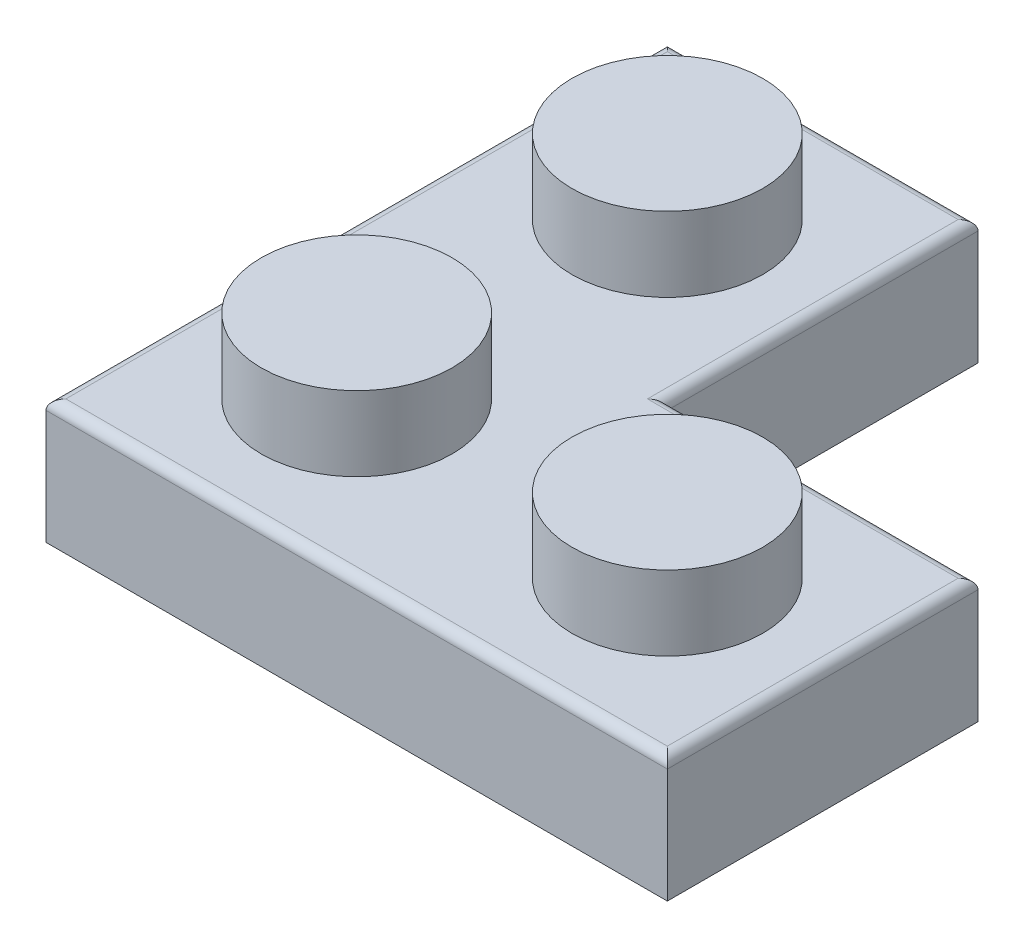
from build123d import *

# Parameters (mm, degrees)
SKETCH1_W               = 15.875
SKETCH1_H               = 15.875
BASE_EXTRUDE_DEPTH      = 3.175
SKETCH2_R               = 2.4384
BOSS_EXTRUDE1_DEPTH     = 1.905
LPATTERN4_COUNT         = 2
LPATTERN4_PITCH         = 7.9375
LPATTERN4_COUNT_DIR2    = 2
LPATTERN4_PITCH_DIR2    = 7.9375
CUT_EXTRUDE1_DEPTH      = 7.9375
CUT_EXTRUDE1_DEPTH_BACK = 12.6656949
SHELL1_T                = -1.5875
SKETCH4_R               = 1.27
BOSS_EXTRUDE2_DEPTH     = 1.5875
CUT_EXTRUDE2_START      = -1.5875
SKETCH5_R               = 0.635
CUT_EXTRUDE2_DEPTH      = 1.5875
FILLET1_R               = 0.254


with BuildPart() as part:
    # Sketch1 → Base-Extrude (new body)
    with BuildSketch(Plane(origin=(0, 0, 0), x_dir=(1, 0, 0), z_dir=(0, 1, 0))):
        Rectangle(SKETCH1_W, SKETCH1_H)
    extrude(amount=BASE_EXTRUDE_DEPTH)

    # Sketch2 → Boss-Extrude1 (add)
    with BuildSketch(Plane(origin=(0, 3.175, 0), x_dir=(-1, 0, 0), z_dir=(0, 1, 0))):
        with Locations(Location((3.96875, 3.96875, 0), (0, 0, 270))):
            Circle(SKETCH2_R)
    boss_extrude1 = extrude(amount=BOSS_EXTRUDE1_DEPTH)

    # LPattern4: Boss-Extrude1 2 × 2
    with Locations(*[(i * LPATTERN4_PITCH, 0, -j * LPATTERN4_PITCH_DIR2) for i in range(LPATTERN4_COUNT) for j in range(LPATTERN4_COUNT_DIR2) if (i, j) != (0, 0)]):
        add(boss_extrude1)

    # Sketch3 → Cut-Extrude1 (cut, two sides: drawn at the far end of the back side and taken through both)
    with BuildSketch(Plane(origin=(0, 3.175, 0), x_dir=(-1, 0, 0), z_dir=(0, 1, 0)).offset(-CUT_EXTRUDE1_DEPTH_BACK)):
        Polygon((0, -53.435079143), (0, -7.9375), (0, 0), (-7.9375, 0), (-53.435079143, 0), (-117.778372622, -64.343293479), (-64.343293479, -117.778372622), align=None)
    extrude(amount=CUT_EXTRUDE1_DEPTH + CUT_EXTRUDE1_DEPTH_BACK, mode=Mode.SUBTRACT)

    # Shell1
    shell1_openings = [part.faces().sort_by_distance(p)[0] for p in [
        (-1.322916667, 0, 1.322916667),
    ]]
    offset(amount=SHELL1_T, openings=shell1_openings, kind=Kind.INTERSECTION)

    # Sketch4 → Boss-Extrude2 (add)
    with BuildSketch(Plane.XZ.offset(-1.5875)):
        with Locations(Location((-3.81, 0, 0), (0, 0, 90))):
            Circle(SKETCH4_R)
        with Locations(Location((0, 3.81, 0), (0, 0, 90))):
            Circle(SKETCH4_R)
    extrude(amount=BOSS_EXTRUDE2_DEPTH)

    # Sketch5 → Cut-Extrude2 (cut)
    with BuildSketch(Plane.XZ.offset(CUT_EXTRUDE2_START)):
        with Locations(Location((0, 3.81, 0), (0, 0, 270))):
            Circle(SKETCH5_R)
        with Locations(Location((-3.81, 0, 0), (0, 0, 270))):
            Circle(SKETCH5_R)
    extrude(amount=CUT_EXTRUDE2_DEPTH, mode=Mode.SUBTRACT)

    # Fillet1
    fillet1_edges = [part.edges().sort_by_distance(p)[0] for p in [
        (7.9375, 3.175, 3.96875),
        (-3.96875, 3.175, -7.9375),
        (0, 3.175, -3.96875),
        (3.96875, 3.175, 0),
        (-7.9375, 3.175, 0),
        (0, 3.175, 7.9375),
    ]]
    fillet(fillet1_edges, radius=FILLET1_R)


solid = part.part
